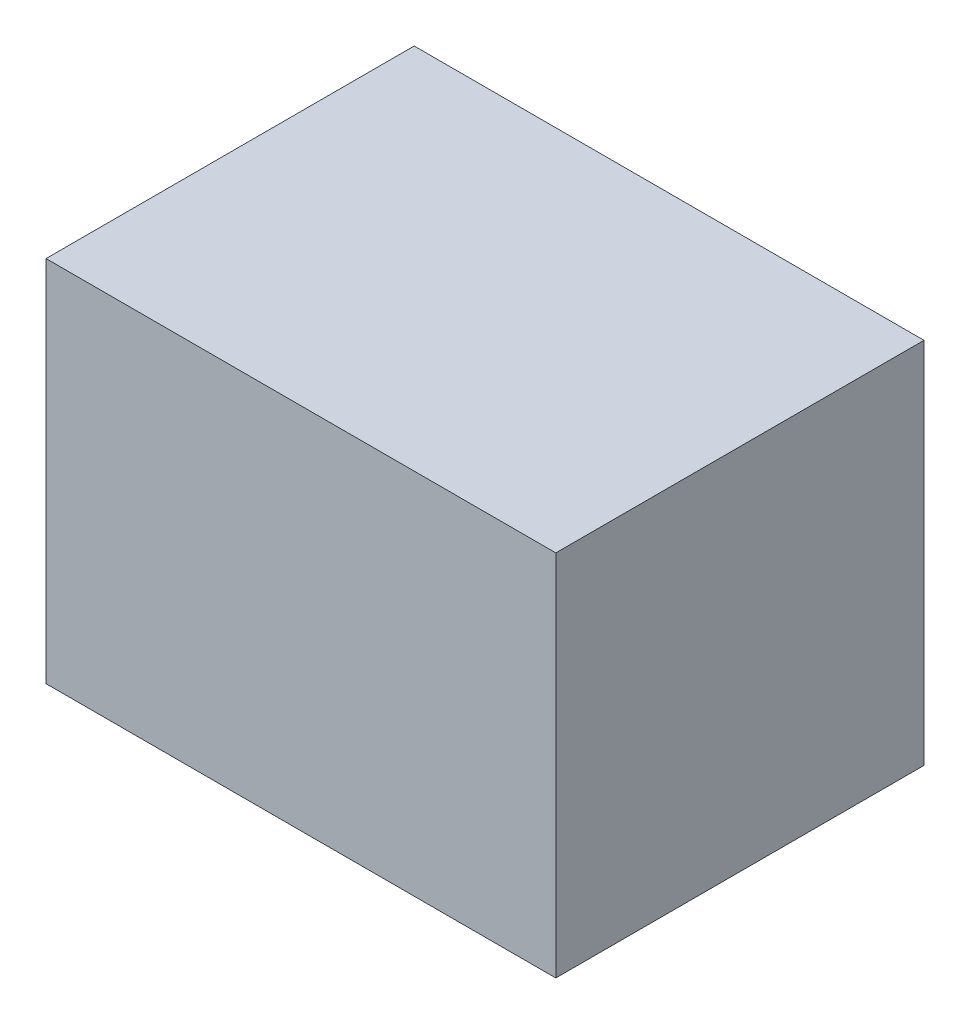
from build123d import *

# Parameters (mm, degrees)
SKETCH1_W           = 4.572
SKETCH1_H           = 3.302
BOSS_EXTRUDE1_DEPTH = 3.302


with BuildPart() as part:
    # Sketch1 → Boss-Extrude1 (new body)
    with BuildSketch(Plane(origin=(0, 0, 0), x_dir=(1, 0, 0), z_dir=(0, 1, 0))):
        Rectangle(SKETCH1_W, SKETCH1_H)
    extrude(amount=BOSS_EXTRUDE1_DEPTH)


solid = part.part
